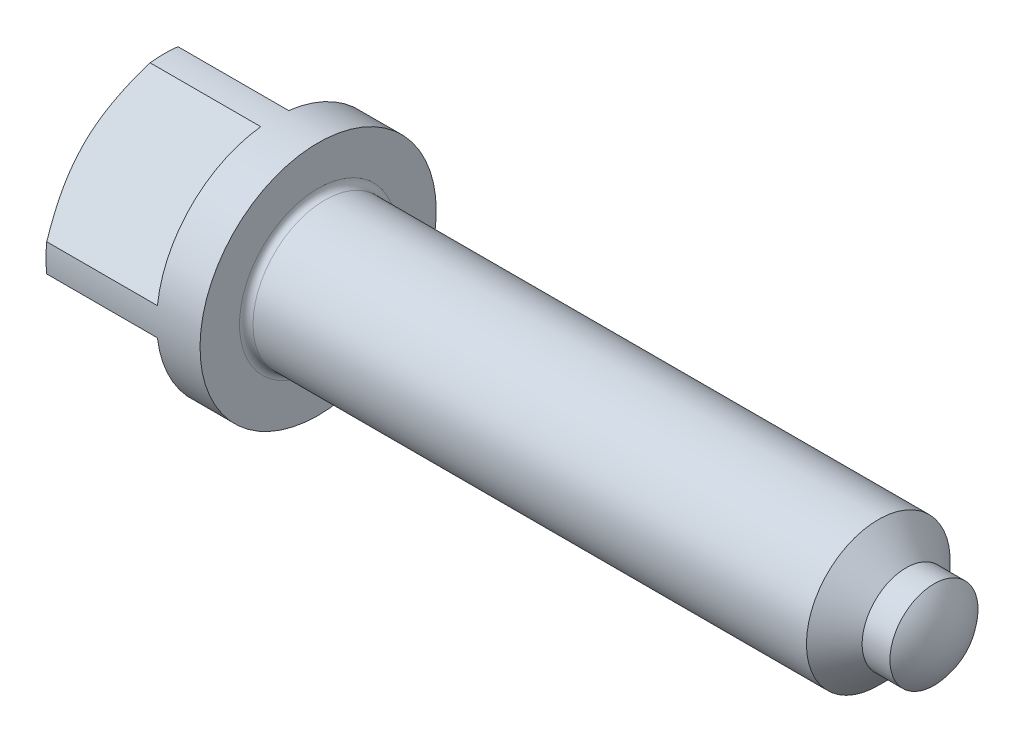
ISO-10303-21;
HEADER;
FILE_DESCRIPTION(('STEP AP214'),'2;1');
FILE_NAME('part.step','',(''),(''),'','','');
FILE_SCHEMA(('AUTOMOTIVE_DESIGN { 1 0 10303 214 1 1 1 1 }'));
ENDSEC;
DATA;
#1=APPLICATION_CONTEXT('core data for automotive mechanical design processes');
#2=APPLICATION_PROTOCOL_DEFINITION('international standard','automotive_design',2000,#1);
#3=PRODUCT_CONTEXT('',#1,'mechanical');
#4=PRODUCT('Part','Part','',(#3));
#5=PRODUCT_RELATED_PRODUCT_CATEGORY('part','',(#4));
#6=PRODUCT_DEFINITION_FORMATION('','',#4);
#7=PRODUCT_DEFINITION_CONTEXT('part definition',#1,'design');
#8=PRODUCT_DEFINITION('design','',#6,#7);
#9=PRODUCT_DEFINITION_SHAPE('','',#8);
#10=(LENGTH_UNIT() NAMED_UNIT(*) SI_UNIT(.MILLI.,.METRE.));
#11=(NAMED_UNIT(*) PLANE_ANGLE_UNIT() SI_UNIT($,.RADIAN.));
#12=(NAMED_UNIT(*) SI_UNIT($,.STERADIAN.) SOLID_ANGLE_UNIT());
#13=UNCERTAINTY_MEASURE_WITH_UNIT(LENGTH_MEASURE(1.E-05),#10,'distance_accuracy_value','');
#14=(GEOMETRIC_REPRESENTATION_CONTEXT(3) GLOBAL_UNCERTAINTY_ASSIGNED_CONTEXT((#13)) GLOBAL_UNIT_ASSIGNED_CONTEXT((#10,
#11,#12)) REPRESENTATION_CONTEXT('',''));
#15=CARTESIAN_POINT('',(0.,0.,0.));
#16=DIRECTION('',(0.,0.,1.));
#17=DIRECTION('',(1.,0.,0.));
#18=AXIS2_PLACEMENT_3D('',#15,#16,#17);
#19=CARTESIAN_POINT('',(20.,1.65445023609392,-13.90189895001));
#20=DIRECTION('',(0.,-0.707106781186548,0.707106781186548));
#21=DIRECTION('',(0.,-0.707106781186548,-0.707106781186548));
#22=AXIS2_PLACEMENT_3D('',#19,#20,#21);
#23=PLANE('',#22);
#24=DIRECTION('',(0.,0.707106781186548,0.707106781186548));
#25=VECTOR('',#24,1.);
#26=CARTESIAN_POINT('',(14.85,1.65445023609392,-13.90189895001));
#27=LINE('',#26,#25);
#28=CARTESIAN_POINT('',(14.85,1.65445023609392,-13.90189895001));
#29=VERTEX_POINT('',#28);
#30=CARTESIAN_POINT('',(14.85,13.90189895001,-1.65445023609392));
#31=VERTEX_POINT('',#30);
#32=EDGE_CURVE('E116',#29,#31,#27,.T.);
#33=ORIENTED_EDGE('',*,*,#32,.F.);
#34=DIRECTION('',(-1.,0.,0.));
#35=VECTOR('',#34,1.);
#36=CARTESIAN_POINT('',(20.,1.65445023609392,-13.90189895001));
#37=LINE('',#36,#35);
#38=CARTESIAN_POINT('',(1.73205080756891,1.65445023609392,-13.90189895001));
#39=VERTEX_POINT('',#38);
#40=EDGE_CURVE('E126',#29,#39,#37,.T.);
#41=ORIENTED_EDGE('',*,*,#40,.T.);
#42=CARTESIAN_POINT('',(1.73215182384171,13.90209895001,-1.65425023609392));
#43=CARTESIAN_POINT('',(1.66601831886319,13.7711586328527,-1.78519055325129));
#44=CARTESIAN_POINT('',(1.60104138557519,13.6399267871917,-1.91642239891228));
#45=CARTESIAN_POINT('',(1.47363094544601,13.3768397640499,-2.17950942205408));
#46=CARTESIAN_POINT('',(1.41119757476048,13.2449845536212,-2.31136463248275));
#47=CARTESIAN_POINT('',(1.22799989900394,12.8482955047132,-2.70805368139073));
#48=CARTESIAN_POINT('',(1.11141311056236,12.5824857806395,-2.9738634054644));
#49=CARTESIAN_POINT('',(0.890886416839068,12.0464411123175,-3.50990807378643));
#50=CARTESIAN_POINT('',(0.787029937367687,11.7761889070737,-3.78016027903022));
#51=CARTESIAN_POINT('',(0.595367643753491,11.2328750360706,-4.3234741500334));
#52=CARTESIAN_POINT('',(0.507559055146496,10.9598138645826,-4.59653532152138));
#53=CARTESIAN_POINT('',(0.353784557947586,10.4218744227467,-5.13447476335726));
#54=CARTESIAN_POINT('',(0.287090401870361,10.1571011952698,-5.39924799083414));
#55=CARTESIAN_POINT('',(0.173286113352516,9.62543079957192,-5.93091838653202));
#56=CARTESIAN_POINT('',(0.126176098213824,9.35853361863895,-6.19781556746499));
#57=CARTESIAN_POINT('',(0.0535591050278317,8.8240846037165,-6.73226458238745));
#58=CARTESIAN_POINT('',(0.0279860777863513,8.55653731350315,-6.9998118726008));
#59=CARTESIAN_POINT('',(-0.000656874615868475,8.02084215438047,-7.53550703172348));
#60=CARTESIAN_POINT('',(-0.00372786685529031,7.75269431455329,-7.80365487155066));
#61=CARTESIAN_POINT('',(0.0120411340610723,7.24025104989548,-8.31609813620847));
#62=CARTESIAN_POINT('',(0.0289841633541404,6.99592507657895,-8.56042410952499));
#63=CARTESIAN_POINT('',(0.081059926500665,6.50825268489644,-9.0480965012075));
#64=CARTESIAN_POINT('',(0.116192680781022,6.2649062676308,-9.29144291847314));
#65=CARTESIAN_POINT('',(0.203533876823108,5.77909949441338,-9.77724969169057));
#66=CARTESIAN_POINT('',(0.255788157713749,5.53664330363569,-10.0197058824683));
#67=CARTESIAN_POINT('',(0.375712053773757,5.05366332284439,-10.5026858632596));
#68=CARTESIAN_POINT('',(0.443381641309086,4.8131395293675,-10.7432096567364));
#69=CARTESIAN_POINT('',(0.595156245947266,4.32514748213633,-11.2312017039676));
#70=CARTESIAN_POINT('',(0.67978703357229,4.07776159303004,-11.4785875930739));
#71=CARTESIAN_POINT('',(0.861721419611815,3.5853161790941,-11.9710330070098));
#72=CARTESIAN_POINT('',(0.959026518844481,3.34025693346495,-12.216092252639));
#73=CARTESIAN_POINT('',(1.16386338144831,2.85377616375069,-12.7025730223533));
#74=CARTESIAN_POINT('',(1.27133564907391,2.61234201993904,-12.9440071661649));
#75=CARTESIAN_POINT('',(1.49533691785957,2.13169474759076,-13.4246544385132));
#76=CARTESIAN_POINT('',(1.6118619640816,1.89248069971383,-13.6638684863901));
#77=CARTESIAN_POINT('',(1.73215182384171,1.65425023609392,-13.90209895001));
#78=B_SPLINE_CURVE_WITH_KNOTS('',3,(#42,#43,#44,#45,#46,#47,#48,#49,#50,#51,#52,#53,#54,#55,#56,
#57,#58,#59,#60,#61,#62,#63,#64,#65,#66,#67,#68,#69,#70,#71,#72,#73,#74,#75,#76,#77),
.UNSPECIFIED.,.F.,.F.,(4,2,2,2,2,2,2,2,2,2,2,2,2,2,2,2,2,4),(0.,0.589890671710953,
1.17981287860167,2.36032226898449,3.54819549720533,4.73586316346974,5.87642136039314,
7.01698638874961,8.15404068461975,9.29104105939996,10.3283802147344,11.365720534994,
12.4058611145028,13.4459998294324,14.5255661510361,15.6052604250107,16.6789871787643,
17.7522474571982),.UNSPECIFIED.);
#79=CARTESIAN_POINT('',(0.,7.77817459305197,-7.77817459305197));
#80=VERTEX_POINT('',#79);
#81=EDGE_CURVE('E177',#80,#39,#78,.T.);
#82=ORIENTED_EDGE('',*,*,#81,.F.);
#83=CARTESIAN_POINT('',(1.73205080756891,13.90189895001,-1.65445023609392));
#84=VERTEX_POINT('',#83);
#85=EDGE_CURVE('E185',#84,#80,#78,.T.);
#86=ORIENTED_EDGE('',*,*,#85,.F.);
#87=DIRECTION('',(-1.,0.,0.));
#88=VECTOR('',#87,1.);
#89=CARTESIAN_POINT('',(20.,13.90189895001,-1.65445023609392));
#90=LINE('',#89,#88);
#91=EDGE_CURVE('E129',#31,#84,#90,.T.);
#92=ORIENTED_EDGE('',*,*,#91,.F.);
#93=EDGE_LOOP('',(#33,#41,#82,#86,#92));
#94=FACE_BOUND('',#93,.T.);
#95=ADVANCED_FACE('F34',(#94),#23,.F.);
#96=CARTESIAN_POINT('',(20.,13.90189895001,1.65445023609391));
#97=DIRECTION('',(0.,-0.707106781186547,-0.707106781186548));
#98=DIRECTION('',(0.,0.707106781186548,-0.707106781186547));
#99=AXIS2_PLACEMENT_3D('',#96,#97,#98);
#100=PLANE('',#99);
#101=DIRECTION('',(0.,-0.707106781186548,0.707106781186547));
#102=VECTOR('',#101,1.);
#103=CARTESIAN_POINT('',(14.85,13.90189895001,1.65445023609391));
#104=LINE('',#103,#102);
#105=CARTESIAN_POINT('',(14.85,13.90189895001,1.6544502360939));
#106=VERTEX_POINT('',#105);
#107=CARTESIAN_POINT('',(14.85,1.65445023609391,13.90189895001));
#108=VERTEX_POINT('',#107);
#109=EDGE_CURVE('E131',#106,#108,#104,.T.);
#110=ORIENTED_EDGE('',*,*,#109,.F.);
#111=DIRECTION('',(-1.,0.,0.));
#112=VECTOR('',#111,1.);
#113=CARTESIAN_POINT('',(20.,13.90189895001,1.65445023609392));
#114=LINE('',#113,#112);
#115=CARTESIAN_POINT('',(1.73205080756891,13.90189895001,1.65445023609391));
#116=VERTEX_POINT('',#115);
#117=EDGE_CURVE('E145',#106,#116,#114,.T.);
#118=ORIENTED_EDGE('',*,*,#117,.T.);
#119=CARTESIAN_POINT('',(1.7321518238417,1.65425023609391,13.90209895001));
#120=CARTESIAN_POINT('',(1.66601831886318,1.78519055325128,13.7711586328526));
#121=CARTESIAN_POINT('',(1.60104138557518,1.91642239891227,13.6399267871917));
#122=CARTESIAN_POINT('',(1.473630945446,2.17950942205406,13.3768397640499));
#123=CARTESIAN_POINT('',(1.41119757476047,2.31136463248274,13.2449845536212));
#124=CARTESIAN_POINT('',(1.22799989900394,2.70805368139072,12.8482955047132));
#125=CARTESIAN_POINT('',(1.11141311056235,2.97386340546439,12.5824857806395));
#126=CARTESIAN_POINT('',(0.890886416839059,3.50990807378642,12.0464411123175));
#127=CARTESIAN_POINT('',(0.787029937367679,3.78016027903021,11.7761889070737));
#128=CARTESIAN_POINT('',(0.595367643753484,4.32347415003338,11.2328750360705));
#129=CARTESIAN_POINT('',(0.507559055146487,4.59653532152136,10.9598138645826));
#130=CARTESIAN_POINT('',(0.353784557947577,5.13447476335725,10.4218744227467));
#131=CARTESIAN_POINT('',(0.287090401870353,5.39924799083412,10.1571011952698));
#132=CARTESIAN_POINT('',(0.173286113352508,5.93091838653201,9.62543079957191));
#133=CARTESIAN_POINT('',(0.126176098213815,6.19781556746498,9.35853361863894));
#134=CARTESIAN_POINT('',(0.0535591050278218,6.73226458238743,8.82408460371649));
#135=CARTESIAN_POINT('',(0.0279860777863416,6.99981187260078,8.55653731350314));
#136=CARTESIAN_POINT('',(-0.000656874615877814,7.53550703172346,8.02084215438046));
#137=CARTESIAN_POINT('',(-0.00372786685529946,7.80365487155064,7.75269431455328));
#138=CARTESIAN_POINT('',(0.0120411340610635,8.31609813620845,7.24025104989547));
#139=CARTESIAN_POINT('',(0.0289841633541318,8.56042410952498,6.99592507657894));
#140=CARTESIAN_POINT('',(0.0810599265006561,9.04809650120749,6.50825268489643));
#141=CARTESIAN_POINT('',(0.116192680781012,9.29144291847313,6.26490626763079));
#142=CARTESIAN_POINT('',(0.203533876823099,9.77724969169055,5.77909949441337));
#143=CARTESIAN_POINT('',(0.25578815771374,10.0197058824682,5.53664330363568));
#144=CARTESIAN_POINT('',(0.375712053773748,10.5026858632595,5.05366332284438));
#145=CARTESIAN_POINT('',(0.443381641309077,10.7432096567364,4.81313952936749));
#146=CARTESIAN_POINT('',(0.595156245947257,11.2312017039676,4.32514748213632));
#147=CARTESIAN_POINT('',(0.679787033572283,11.4785875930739,4.07776159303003));
#148=CARTESIAN_POINT('',(0.861721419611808,11.9710330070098,3.58531617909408));
#149=CARTESIAN_POINT('',(0.959026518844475,12.216092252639,3.34025693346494));
#150=CARTESIAN_POINT('',(1.16386338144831,12.7025730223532,2.85377616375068));
#151=CARTESIAN_POINT('',(1.2713356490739,12.9440071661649,2.61234201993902));
#152=CARTESIAN_POINT('',(1.49533691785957,13.4246544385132,2.13169474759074));
#153=CARTESIAN_POINT('',(1.6118619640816,13.6638684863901,1.89248069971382));
#154=CARTESIAN_POINT('',(1.73215182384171,13.90209895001,1.65425023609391));
#155=B_SPLINE_CURVE_WITH_KNOTS('',3,(#119,#120,#121,#122,#123,#124,#125,#126,#127,#128,#129,
#130,#131,#132,#133,#134,#135,#136,#137,#138,#139,#140,#141,#142,#143,#144,#145,#146,#147,#148,
#149,#150,#151,#152,#153,#154),.UNSPECIFIED.,.F.,.F.,(4,2,2,2,2,2,2,2,2,2,2,2,2,2,2,2,2,4),(0.,
0.589890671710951,1.17981287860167,2.36032226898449,3.54819549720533,4.73586316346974,
5.87642136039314,7.01698638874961,8.15404068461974,9.29104105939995,10.3283802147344,
11.365720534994,12.4058611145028,13.4459998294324,14.5255661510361,15.6052604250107,
16.6789871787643,17.7522474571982),.UNSPECIFIED.);
#156=CARTESIAN_POINT('',(0.,7.77817459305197,7.77817459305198));
#157=VERTEX_POINT('',#156);
#158=EDGE_CURVE('E281',#157,#116,#155,.T.);
#159=ORIENTED_EDGE('',*,*,#158,.F.);
#160=CARTESIAN_POINT('',(1.73205080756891,1.65445023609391,13.90189895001));
#161=VERTEX_POINT('',#160);
#162=EDGE_CURVE('E49',#161,#157,#155,.T.);
#163=ORIENTED_EDGE('',*,*,#162,.F.);
#164=DIRECTION('',(-1.,0.,0.));
#165=VECTOR('',#164,1.);
#166=CARTESIAN_POINT('',(20.,1.65445023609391,13.90189895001));
#167=LINE('',#166,#165);
#168=EDGE_CURVE('E276',#108,#161,#167,.T.);
#169=ORIENTED_EDGE('',*,*,#168,.F.);
#170=EDGE_LOOP('',(#110,#118,#159,#163,#169));
#171=FACE_BOUND('',#170,.T.);
#172=ADVANCED_FACE('F166',(#171),#100,.F.);
#173=CARTESIAN_POINT('',(20.,-13.90189895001,1.65445023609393));
#174=DIRECTION('',(0.,0.707106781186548,-0.707106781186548));
#175=DIRECTION('',(0.,0.707106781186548,0.707106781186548));
#176=AXIS2_PLACEMENT_3D('',#173,#174,#175);
#177=PLANE('',#176);
#178=DIRECTION('',(0.,-0.707106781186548,-0.707106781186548));
#179=VECTOR('',#178,1.);
#180=CARTESIAN_POINT('',(14.85,-13.90189895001,1.65445023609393));
#181=LINE('',#180,#179);
#182=CARTESIAN_POINT('',(14.85,-1.65445023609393,13.90189895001));
#183=VERTEX_POINT('',#182);
#184=CARTESIAN_POINT('',(14.85,-13.90189895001,1.65445023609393));
#185=VERTEX_POINT('',#184);
#186=EDGE_CURVE('E120',#183,#185,#181,.T.);
#187=ORIENTED_EDGE('',*,*,#186,.F.);
#188=DIRECTION('',(-1.,0.,0.));
#189=VECTOR('',#188,1.);
#190=CARTESIAN_POINT('',(20.,-1.65445023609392,13.90189895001));
#191=LINE('',#190,#189);
#192=CARTESIAN_POINT('',(1.73205080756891,-1.65445023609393,13.90189895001));
#193=VERTEX_POINT('',#192);
#194=EDGE_CURVE('E274',#183,#193,#191,.T.);
#195=ORIENTED_EDGE('',*,*,#194,.T.);
#196=CARTESIAN_POINT('',(1.73215182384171,-13.90209895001,1.65425023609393));
#197=CARTESIAN_POINT('',(1.66601831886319,-13.7711586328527,1.7851905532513));
#198=CARTESIAN_POINT('',(1.60104138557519,-13.6399267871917,1.91642239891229));
#199=CARTESIAN_POINT('',(1.47363094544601,-13.3768397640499,2.17950942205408));
#200=CARTESIAN_POINT('',(1.41119757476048,-13.2449845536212,2.31136463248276));
#201=CARTESIAN_POINT('',(1.22799989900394,-12.8482955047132,2.70805368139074));
#202=CARTESIAN_POINT('',(1.11141311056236,-12.5824857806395,2.9738634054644));
#203=CARTESIAN_POINT('',(0.890886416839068,-12.0464411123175,3.50990807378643));
#204=CARTESIAN_POINT('',(0.787029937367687,-11.7761889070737,3.78016027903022));
#205=CARTESIAN_POINT('',(0.595367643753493,-11.2328750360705,4.3234741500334));
#206=CARTESIAN_POINT('',(0.507559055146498,-10.9598138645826,4.59653532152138));
#207=CARTESIAN_POINT('',(0.353784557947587,-10.4218744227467,5.13447476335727));
#208=CARTESIAN_POINT('',(0.287090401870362,-10.1571011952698,5.39924799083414));
#209=CARTESIAN_POINT('',(0.173286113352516,-9.62543079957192,5.93091838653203));
#210=CARTESIAN_POINT('',(0.126176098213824,-9.35853361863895,6.197815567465));
#211=CARTESIAN_POINT('',(0.0535591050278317,-8.82408460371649,6.73226458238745));
#212=CARTESIAN_POINT('',(0.0279860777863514,-8.55653731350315,6.9998118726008));
#213=CARTESIAN_POINT('',(-0.000656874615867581,-8.02084215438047,7.53550703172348));
#214=CARTESIAN_POINT('',(-0.00372786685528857,-7.75269431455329,7.80365487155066));
#215=CARTESIAN_POINT('',(0.0120411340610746,-7.24025104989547,8.31609813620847));
#216=CARTESIAN_POINT('',(0.0289841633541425,-6.99592507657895,8.560424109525));
#217=CARTESIAN_POINT('',(0.0810599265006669,-6.50825268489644,9.04809650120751));
#218=CARTESIAN_POINT('',(0.116192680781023,-6.2649062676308,9.29144291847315));
#219=CARTESIAN_POINT('',(0.203533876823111,-5.77909949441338,9.77724969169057));
#220=CARTESIAN_POINT('',(0.255788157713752,-5.53664330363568,10.0197058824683));
#221=CARTESIAN_POINT('',(0.37571205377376,-5.05366332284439,10.5026858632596));
#222=CARTESIAN_POINT('',(0.443381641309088,-4.8131395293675,10.7432096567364));
#223=CARTESIAN_POINT('',(0.595156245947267,-4.32514748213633,11.2312017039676));
#224=CARTESIAN_POINT('',(0.679787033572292,-4.07776159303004,11.4785875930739));
#225=CARTESIAN_POINT('',(0.861721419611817,-3.58531617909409,11.9710330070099));
#226=CARTESIAN_POINT('',(0.959026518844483,-3.34025693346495,12.216092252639));
#227=CARTESIAN_POINT('',(1.16386338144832,-2.85377616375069,12.7025730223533));
#228=CARTESIAN_POINT('',(1.27133564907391,-2.61234201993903,12.9440071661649));
#229=CARTESIAN_POINT('',(1.49533691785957,-2.13169474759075,13.4246544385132));
#230=CARTESIAN_POINT('',(1.6118619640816,-1.89248069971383,13.6638684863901));
#231=CARTESIAN_POINT('',(1.73215182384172,-1.65425023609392,13.90209895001));
#232=B_SPLINE_CURVE_WITH_KNOTS('',3,(#196,#197,#198,#199,#200,#201,#202,#203,#204,#205,#206,
#207,#208,#209,#210,#211,#212,#213,#214,#215,#216,#217,#218,#219,#220,#221,#222,#223,#224,#225,
#226,#227,#228,#229,#230,#231),.UNSPECIFIED.,.F.,.F.,(4,2,2,2,2,2,2,2,2,2,2,2,2,2,2,2,2,4),(0.,
0.589890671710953,1.17981287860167,2.36032226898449,3.54819549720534,4.73586316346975,
5.87642136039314,7.01698638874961,8.15404068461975,9.29104105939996,10.3283802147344,
11.365720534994,12.4058611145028,13.4459998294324,14.5255661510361,15.6052604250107,
16.6789871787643,17.7522474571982),.UNSPECIFIED.);
#233=CARTESIAN_POINT('',(0.,-7.77817459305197,7.77817459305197));
#234=VERTEX_POINT('',#233);
#235=EDGE_CURVE('E223',#234,#193,#232,.T.);
#236=ORIENTED_EDGE('',*,*,#235,.F.);
#237=CARTESIAN_POINT('',(1.73205080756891,-13.90189895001,1.65445023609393));
#238=VERTEX_POINT('',#237);
#239=EDGE_CURVE('E57',#238,#234,#232,.T.);
#240=ORIENTED_EDGE('',*,*,#239,.F.);
#241=DIRECTION('',(-1.,0.,0.));
#242=VECTOR('',#241,1.);
#243=CARTESIAN_POINT('',(20.,-13.90189895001,1.65445023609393));
#244=LINE('',#243,#242);
#245=EDGE_CURVE('E272',#185,#238,#244,.T.);
#246=ORIENTED_EDGE('',*,*,#245,.F.);
#247=EDGE_LOOP('',(#187,#195,#236,#240,#246));
#248=FACE_BOUND('',#247,.T.);
#249=ADVANCED_FACE('F170',(#248),#177,.F.);
#250=CARTESIAN_POINT('',(20.,-1.65445023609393,-13.90189895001));
#251=DIRECTION('',(0.,0.707106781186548,0.707106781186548));
#252=DIRECTION('',(0.,-0.707106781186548,0.707106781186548));
#253=AXIS2_PLACEMENT_3D('',#250,#251,#252);
#254=PLANE('',#253);
#255=DIRECTION('',(0.,0.707106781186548,-0.707106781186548));
#256=VECTOR('',#255,1.);
#257=CARTESIAN_POINT('',(14.85,-1.65445023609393,-13.90189895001));
#258=LINE('',#257,#256);
#259=CARTESIAN_POINT('',(14.85,-13.90189895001,-1.65445023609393));
#260=VERTEX_POINT('',#259);
#261=CARTESIAN_POINT('',(14.85,-1.65445023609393,-13.90189895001));
#262=VERTEX_POINT('',#261);
#263=EDGE_CURVE('E149',#260,#262,#258,.T.);
#264=ORIENTED_EDGE('',*,*,#263,.F.);
#265=DIRECTION('',(-1.,0.,0.));
#266=VECTOR('',#265,1.);
#267=CARTESIAN_POINT('',(20.,-13.90189895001,-1.65445023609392));
#268=LINE('',#267,#266);
#269=CARTESIAN_POINT('',(1.73205080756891,-13.90189895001,-1.65445023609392));
#270=VERTEX_POINT('',#269);
#271=EDGE_CURVE('E270',#260,#270,#268,.T.);
#272=ORIENTED_EDGE('',*,*,#271,.T.);
#273=CARTESIAN_POINT('',(1.73215182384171,-1.65425023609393,-13.90209895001));
#274=CARTESIAN_POINT('',(1.66601831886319,-1.7851905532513,-13.7711586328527));
#275=CARTESIAN_POINT('',(1.60104138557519,-1.91642239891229,-13.6399267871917));
#276=CARTESIAN_POINT('',(1.47363094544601,-2.17950942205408,-13.3768397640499));
#277=CARTESIAN_POINT('',(1.41119757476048,-2.31136463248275,-13.2449845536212));
#278=CARTESIAN_POINT('',(1.22799989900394,-2.70805368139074,-12.8482955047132));
#279=CARTESIAN_POINT('',(1.11141311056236,-2.9738634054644,-12.5824857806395));
#280=CARTESIAN_POINT('',(0.890886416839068,-3.50990807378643,-12.0464411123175));
#281=CARTESIAN_POINT('',(0.787029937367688,-3.78016027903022,-11.7761889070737));
#282=CARTESIAN_POINT('',(0.595367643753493,-4.3234741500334,-11.2328750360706));
#283=CARTESIAN_POINT('',(0.507559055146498,-4.59653532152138,-10.9598138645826));
#284=CARTESIAN_POINT('',(0.353784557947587,-5.13447476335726,-10.4218744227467));
#285=CARTESIAN_POINT('',(0.287090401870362,-5.39924799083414,-10.1571011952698));
#286=CARTESIAN_POINT('',(0.173286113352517,-5.93091838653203,-9.62543079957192));
#287=CARTESIAN_POINT('',(0.126176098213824,-6.197815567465,-9.35853361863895));
#288=CARTESIAN_POINT('',(0.0535591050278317,-6.73226458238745,-8.8240846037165));
#289=CARTESIAN_POINT('',(0.0279860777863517,-6.9998118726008,-8.55653731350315));
#290=CARTESIAN_POINT('',(-0.000656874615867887,-7.53550703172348,-8.02084215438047));
#291=CARTESIAN_POINT('',(-0.00372786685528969,-7.80365487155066,-7.75269431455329));
#292=CARTESIAN_POINT('',(0.0120411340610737,-8.31609813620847,-7.24025104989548));
#293=CARTESIAN_POINT('',(0.0289841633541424,-8.56042410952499,-6.99592507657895));
#294=CARTESIAN_POINT('',(0.081059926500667,-9.0480965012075,-6.50825268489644));
#295=CARTESIAN_POINT('',(0.116192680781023,-9.29144291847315,-6.2649062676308));
#296=CARTESIAN_POINT('',(0.203533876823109,-9.77724969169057,-5.77909949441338));
#297=CARTESIAN_POINT('',(0.25578815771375,-10.0197058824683,-5.53664330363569));
#298=CARTESIAN_POINT('',(0.375712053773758,-10.5026858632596,-5.05366332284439));
#299=CARTESIAN_POINT('',(0.443381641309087,-10.7432096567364,-4.8131395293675));
#300=CARTESIAN_POINT('',(0.595156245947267,-11.2312017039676,-4.32514748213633));
#301=CARTESIAN_POINT('',(0.679787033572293,-11.4785875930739,-4.07776159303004));
#302=CARTESIAN_POINT('',(0.861721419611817,-11.9710330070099,-3.5853161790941));
#303=CARTESIAN_POINT('',(0.959026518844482,-12.216092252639,-3.34025693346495));
#304=CARTESIAN_POINT('',(1.16386338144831,-12.7025730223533,-2.85377616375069));
#305=CARTESIAN_POINT('',(1.27133564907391,-12.9440071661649,-2.61234201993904));
#306=CARTESIAN_POINT('',(1.49533691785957,-13.4246544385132,-2.13169474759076));
#307=CARTESIAN_POINT('',(1.6118619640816,-13.6638684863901,-1.89248069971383));
#308=CARTESIAN_POINT('',(1.73215182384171,-13.90209895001,-1.65425023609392));
#309=B_SPLINE_CURVE_WITH_KNOTS('',3,(#273,#274,#275,#276,#277,#278,#279,#280,#281,#282,#283,
#284,#285,#286,#287,#288,#289,#290,#291,#292,#293,#294,#295,#296,#297,#298,#299,#300,#301,#302,
#303,#304,#305,#306,#307,#308),.UNSPECIFIED.,.F.,.F.,(4,2,2,2,2,2,2,2,2,2,2,2,2,2,2,2,2,4),(0.,
0.589890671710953,1.17981287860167,2.36032226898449,3.54819549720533,4.73586316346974,
5.87642136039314,7.01698638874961,8.15404068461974,9.29104105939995,10.3283802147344,
11.365720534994,12.4058611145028,13.4459998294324,14.5255661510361,15.6052604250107,
16.6789871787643,17.7522474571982),.UNSPECIFIED.);
#310=CARTESIAN_POINT('',(0.,-7.77817459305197,-7.77817459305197));
#311=VERTEX_POINT('',#310);
#312=EDGE_CURVE('E207',#311,#270,#309,.T.);
#313=ORIENTED_EDGE('',*,*,#312,.F.);
#314=CARTESIAN_POINT('',(1.73205080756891,-1.65445023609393,-13.90189895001));
#315=VERTEX_POINT('',#314);
#316=EDGE_CURVE('E295',#315,#311,#309,.T.);
#317=ORIENTED_EDGE('',*,*,#316,.F.);
#318=DIRECTION('',(-1.,0.,0.));
#319=VECTOR('',#318,1.);
#320=CARTESIAN_POINT('',(20.,-1.65445023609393,-13.90189895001));
#321=LINE('',#320,#319);
#322=EDGE_CURVE('E268',#262,#315,#321,.T.);
#323=ORIENTED_EDGE('',*,*,#322,.F.);
#324=EDGE_LOOP('',(#264,#272,#313,#317,#323));
#325=FACE_BOUND('',#324,.T.);
#326=ADVANCED_FACE('F227',(#325),#254,.F.);
#327=CARTESIAN_POINT('',(20.,0.,0.));
#328=DIRECTION('',(-1.,0.,0.));
#329=DIRECTION('',(0.,0.,1.));
#330=AXIS2_PLACEMENT_3D('',#327,#328,#329);
#331=CYLINDRICAL_SURFACE('',#330,14.);
#332=CARTESIAN_POINT('',(14.85,0.,0.));
#333=DIRECTION('',(1.,0.,0.));
#334=DIRECTION('',(0.,0.,-1.));
#335=AXIS2_PLACEMENT_3D('',#332,#333,#334);
#336=CIRCLE('',#335,14.);
#337=EDGE_CURVE('E123',#260,#262,#336,.T.);
#338=ORIENTED_EDGE('',*,*,#337,.T.);
#339=ORIENTED_EDGE('',*,*,#322,.T.);
#340=CARTESIAN_POINT('',(1.73205080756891,0.,0.));
#341=DIRECTION('',(1.,0.,0.));
#342=DIRECTION('',(0.,0.,-1.));
#343=AXIS2_PLACEMENT_3D('',#340,#341,#342);
#344=CIRCLE('',#343,14.);
#345=EDGE_CURVE('E138',#39,#315,#344,.F.);
#346=ORIENTED_EDGE('',*,*,#345,.F.);
#347=ORIENTED_EDGE('',*,*,#40,.F.);
#348=EDGE_CURVE('E113',#29,#31,#336,.T.);
#349=ORIENTED_EDGE('',*,*,#348,.T.);
#350=ORIENTED_EDGE('',*,*,#91,.T.);
#351=CARTESIAN_POINT('',(1.73205080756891,0.,0.));
#352=DIRECTION('',(1.,0.,0.));
#353=DIRECTION('',(0.,0.,-1.));
#354=AXIS2_PLACEMENT_3D('',#351,#352,#353);
#355=CIRCLE('',#354,14.);
#356=EDGE_CURVE('E191',#116,#84,#355,.F.);
#357=ORIENTED_EDGE('',*,*,#356,.F.);
#358=ORIENTED_EDGE('',*,*,#117,.F.);
#359=EDGE_CURVE('E121',#106,#108,#336,.T.);
#360=ORIENTED_EDGE('',*,*,#359,.T.);
#361=ORIENTED_EDGE('',*,*,#168,.T.);
#362=CARTESIAN_POINT('',(1.73205080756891,0.,0.));
#363=DIRECTION('',(1.,0.,0.));
#364=DIRECTION('',(0.,0.,-1.));
#365=AXIS2_PLACEMENT_3D('',#362,#363,#364);
#366=CIRCLE('',#365,14.);
#367=EDGE_CURVE('E288',#193,#161,#366,.F.);
#368=ORIENTED_EDGE('',*,*,#367,.F.);
#369=ORIENTED_EDGE('',*,*,#194,.F.);
#370=EDGE_CURVE('E307',#183,#185,#336,.T.);
#371=ORIENTED_EDGE('',*,*,#370,.T.);
#372=ORIENTED_EDGE('',*,*,#245,.T.);
#373=CARTESIAN_POINT('',(1.73205080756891,0.,0.));
#374=DIRECTION('',(1.,0.,0.));
#375=DIRECTION('',(0.,0.,-1.));
#376=AXIS2_PLACEMENT_3D('',#373,#374,#375);
#377=CIRCLE('',#376,14.);
#378=EDGE_CURVE('E222',#270,#238,#377,.F.);
#379=ORIENTED_EDGE('',*,*,#378,.F.);
#380=ORIENTED_EDGE('',*,*,#271,.F.);
#381=EDGE_LOOP('',(#338,#339,#346,#347,#349,#350,#357,#358,#360,#361,#368,#369,#371,#372,#379,#380));
#382=FACE_BOUND('',#381,.T.);
#383=CARTESIAN_POINT('',(20.,0.,0.));
#384=DIRECTION('',(1.,0.,0.));
#385=DIRECTION('',(0.,0.,-1.));
#386=AXIS2_PLACEMENT_3D('',#383,#384,#385);
#387=CIRCLE('',#386,14.);
#388=CARTESIAN_POINT('',(20.,0.,-14.));
#389=VERTEX_POINT('',#388);
#390=EDGE_CURVE('E263',#389,#389,#387,.T.);
#391=ORIENTED_EDGE('',*,*,#390,.F.);
#392=EDGE_LOOP('',(#391));
#393=FACE_BOUND('',#392,.T.);
#394=ADVANCED_FACE('F135',(#382,#393),#331,.T.);
#395=CARTESIAN_POINT('',(20.,0.,0.));
#396=DIRECTION('',(1.,0.,0.));
#397=DIRECTION('',(0.,0.,-1.));
#398=AXIS2_PLACEMENT_3D('',#395,#396,#397);
#399=PLANE('',#398);
#400=CARTESIAN_POINT('',(20.,0.,0.));
#401=DIRECTION('',(1.,0.,0.));
#402=DIRECTION('',(0.,0.,-1.));
#403=AXIS2_PLACEMENT_3D('',#400,#401,#402);
#404=CIRCLE('',#403,9.32079728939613);
#405=CARTESIAN_POINT('',(20.,0.,-9.32079728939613));
#406=VERTEX_POINT('',#405);
#407=EDGE_CURVE('E42',#406,#406,#404,.F.);
#408=ORIENTED_EDGE('',*,*,#407,.T.);
#409=EDGE_LOOP('',(#408));
#410=FACE_BOUND('',#409,.T.);
#411=ORIENTED_EDGE('',*,*,#390,.T.);
#412=EDGE_LOOP('',(#411));
#413=FACE_BOUND('',#412,.T.);
#414=ADVANCED_FACE('F153',(#410,#413),#399,.T.);
#415=CARTESIAN_POINT('',(87.1841145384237,0.,0.));
#416=DIRECTION('',(-1.,0.,0.));
#417=DIRECTION('',(0.,1.,0.));
#418=AXIS2_PLACEMENT_3D('',#415,#416,#417);
#419=SPHERICAL_SURFACE('',#418,7.81588546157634);
#420=CARTESIAN_POINT('',(93.,0.,0.));
#421=DIRECTION('',(-1.,0.,0.));
#422=DIRECTION('',(0.,0.,1.));
#423=AXIS2_PLACEMENT_3D('',#420,#421,#422);
#424=CIRCLE('',#423,5.22145016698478);
#425=CARTESIAN_POINT('',(93.,0.,5.22145016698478));
#426=VERTEX_POINT('',#425);
#427=EDGE_CURVE('E260',#426,#426,#424,.T.);
#428=ORIENTED_EDGE('',*,*,#427,.F.);
#429=EDGE_LOOP('',(#428));
#430=FACE_BOUND('',#429,.T.);
#431=ADVANCED_FACE('F239',(#430),#419,.T.);
#432=CARTESIAN_POINT('',(0.,0.,0.));
#433=DIRECTION('',(-1.,0.,0.));
#434=DIRECTION('',(0.,0.,1.));
#435=AXIS2_PLACEMENT_3D('',#432,#433,#434);
#436=CYLINDRICAL_SURFACE('',#435,5.22145016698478);
#437=CARTESIAN_POINT('',(89.7,0.,0.));
#438=DIRECTION('',(-1.,0.,0.));
#439=DIRECTION('',(0.,0.,1.));
#440=AXIS2_PLACEMENT_3D('',#437,#438,#439);
#441=CIRCLE('',#440,5.22145016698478);
#442=CARTESIAN_POINT('',(89.7,0.,5.22145016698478));
#443=VERTEX_POINT('',#442);
#444=EDGE_CURVE('E259',#443,#443,#441,.T.);
#445=ORIENTED_EDGE('',*,*,#444,.F.);
#446=EDGE_LOOP('',(#445));
#447=FACE_BOUND('',#446,.T.);
#448=ORIENTED_EDGE('',*,*,#427,.T.);
#449=EDGE_LOOP('',(#448));
#450=FACE_BOUND('',#449,.T.);
#451=ADVANCED_FACE('F242',(#447,#450),#436,.T.);
#452=CARTESIAN_POINT('',(89.7,0.,0.));
#453=DIRECTION('',(-1.,0.,0.));
#454=DIRECTION('',(0.,0.,1.));
#455=AXIS2_PLACEMENT_3D('',#452,#453,#454);
#456=CONICAL_SURFACE('',#455,5.22145016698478,0.78539816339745);
#457=CARTESIAN_POINT('',(86.4006528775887,0.,0.));
#458=DIRECTION('',(-1.,0.,0.));
#459=DIRECTION('',(0.,0.,1.));
#460=AXIS2_PLACEMENT_3D('',#457,#458,#459);
#461=CIRCLE('',#460,8.52079728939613);
#462=CARTESIAN_POINT('',(86.4006528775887,0.,8.52079728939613));
#463=VERTEX_POINT('',#462);
#464=EDGE_CURVE('E256',#463,#463,#461,.T.);
#465=ORIENTED_EDGE('',*,*,#464,.F.);
#466=EDGE_LOOP('',(#465));
#467=FACE_BOUND('',#466,.T.);
#468=ORIENTED_EDGE('',*,*,#444,.T.);
#469=EDGE_LOOP('',(#468));
#470=FACE_BOUND('',#469,.T.);
#471=ADVANCED_FACE('F245',(#467,#470),#456,.T.);
#472=CARTESIAN_POINT('',(0.,0.,0.));
#473=DIRECTION('',(-1.,0.,0.));
#474=DIRECTION('',(0.,0.,1.));
#475=AXIS2_PLACEMENT_3D('',#472,#473,#474);
#476=CYLINDRICAL_SURFACE('',#475,8.52079728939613);
#477=CARTESIAN_POINT('',(20.8,0.,0.));
#478=DIRECTION('',(1.,0.,0.));
#479=DIRECTION('',(0.,0.,-1.));
#480=AXIS2_PLACEMENT_3D('',#477,#478,#479);
#481=CIRCLE('',#480,8.52079728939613);
#482=CARTESIAN_POINT('',(20.8,0.,-8.52079728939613));
#483=VERTEX_POINT('',#482);
#484=EDGE_CURVE('E12',#483,#483,#481,.T.);
#485=ORIENTED_EDGE('',*,*,#484,.T.);
#486=EDGE_LOOP('',(#485));
#487=FACE_BOUND('',#486,.T.);
#488=ORIENTED_EDGE('',*,*,#464,.T.);
#489=EDGE_LOOP('',(#488));
#490=FACE_BOUND('',#489,.T.);
#491=ADVANCED_FACE('F202',(#487,#490),#476,.T.);
#492=CARTESIAN_POINT('',(0.,0.,0.));
#493=DIRECTION('',(1.,0.,0.));
#494=DIRECTION('',(0.,0.,-1.));
#495=AXIS2_PLACEMENT_3D('',#492,#493,#494);
#496=CONICAL_SURFACE('',#495,10.9999999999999,1.0471975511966);
#497=ORIENTED_EDGE('',*,*,#81,.T.);
#498=ORIENTED_EDGE('',*,*,#345,.T.);
#499=ORIENTED_EDGE('',*,*,#316,.T.);
#500=CARTESIAN_POINT('',(0.,0.,0.));
#501=DIRECTION('',(1.,0.,0.));
#502=DIRECTION('',(0.,0.,-1.));
#503=AXIS2_PLACEMENT_3D('',#500,#501,#502);
#504=CIRCLE('',#503,10.9999999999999);
#505=EDGE_CURVE('E139',#311,#80,#504,.T.);
#506=ORIENTED_EDGE('',*,*,#505,.T.);
#507=EDGE_LOOP('',(#497,#498,#499,#506));
#508=FACE_BOUND('',#507,.T.);
#509=ADVANCED_FACE('F200',(#508),#496,.T.);
#510=ORIENTED_EDGE('',*,*,#239,.T.);
#511=EDGE_CURVE('E142',#234,#311,#504,.T.);
#512=ORIENTED_EDGE('',*,*,#511,.T.);
#513=ORIENTED_EDGE('',*,*,#312,.T.);
#514=ORIENTED_EDGE('',*,*,#378,.T.);
#515=EDGE_LOOP('',(#510,#512,#513,#514));
#516=FACE_BOUND('',#515,.T.);
#517=ADVANCED_FACE('F201',(#516),#496,.T.);
#518=ORIENTED_EDGE('',*,*,#162,.T.);
#519=EDGE_CURVE('E144',#157,#234,#504,.T.);
#520=ORIENTED_EDGE('',*,*,#519,.T.);
#521=ORIENTED_EDGE('',*,*,#235,.T.);
#522=ORIENTED_EDGE('',*,*,#367,.T.);
#523=EDGE_LOOP('',(#518,#520,#521,#522));
#524=FACE_BOUND('',#523,.T.);
#525=ADVANCED_FACE('F198',(#524),#496,.T.);
#526=ORIENTED_EDGE('',*,*,#356,.T.);
#527=ORIENTED_EDGE('',*,*,#85,.T.);
#528=CARTESIAN_POINT('',(0.,0.,0.));
#529=DIRECTION('',(-1.,0.,0.));
#530=DIRECTION('',(0.,0.,1.));
#531=AXIS2_PLACEMENT_3D('',#528,#529,#530);
#532=CIRCLE('',#531,10.9999999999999);
#533=EDGE_CURVE('E130',#157,#80,#532,.T.);
#534=ORIENTED_EDGE('',*,*,#533,.F.);
#535=ORIENTED_EDGE('',*,*,#158,.T.);
#536=EDGE_LOOP('',(#526,#527,#534,#535));
#537=FACE_BOUND('',#536,.T.);
#538=ADVANCED_FACE('F193',(#537),#496,.T.);
#539=CARTESIAN_POINT('',(0.,0.,0.));
#540=DIRECTION('',(1.,0.,0.));
#541=DIRECTION('',(0.,0.,-1.));
#542=AXIS2_PLACEMENT_3D('',#539,#540,#541);
#543=PLANE('',#542);
#544=ORIENTED_EDGE('',*,*,#533,.T.);
#545=ORIENTED_EDGE('',*,*,#505,.F.);
#546=ORIENTED_EDGE('',*,*,#511,.F.);
#547=ORIENTED_EDGE('',*,*,#519,.F.);
#548=EDGE_LOOP('',(#544,#545,#546,#547));
#549=FACE_BOUND('',#548,.T.);
#550=ADVANCED_FACE('F197',(#549),#543,.F.);
#551=CARTESIAN_POINT('',(14.85,0.,0.));
#552=DIRECTION('',(1.,0.,0.));
#553=DIRECTION('',(0.,0.,-1.));
#554=AXIS2_PLACEMENT_3D('',#551,#552,#553);
#555=PLANE('',#554);
#556=ORIENTED_EDGE('',*,*,#337,.F.);
#557=ORIENTED_EDGE('',*,*,#263,.T.);
#558=EDGE_LOOP('',(#556,#557));
#559=FACE_BOUND('',#558,.T.);
#560=ADVANCED_FACE('F163',(#559),#555,.F.);
#561=ORIENTED_EDGE('',*,*,#370,.F.);
#562=ORIENTED_EDGE('',*,*,#186,.T.);
#563=EDGE_LOOP('',(#561,#562));
#564=FACE_BOUND('',#563,.T.);
#565=ADVANCED_FACE('F306',(#564),#555,.F.);
#566=ORIENTED_EDGE('',*,*,#359,.F.);
#567=ORIENTED_EDGE('',*,*,#109,.T.);
#568=EDGE_LOOP('',(#566,#567));
#569=FACE_BOUND('',#568,.T.);
#570=ADVANCED_FACE('F161',(#569),#555,.F.);
#571=ORIENTED_EDGE('',*,*,#348,.F.);
#572=ORIENTED_EDGE('',*,*,#32,.T.);
#573=EDGE_LOOP('',(#571,#572));
#574=FACE_BOUND('',#573,.T.);
#575=ADVANCED_FACE('F115',(#574),#555,.F.);
#576=CARTESIAN_POINT('',(20.8,0.,0.));
#577=DIRECTION('',(1.,0.,0.));
#578=DIRECTION('',(0.,0.,-1.));
#579=AXIS2_PLACEMENT_3D('',#576,#577,#578);
#580=TOROIDAL_SURFACE('',#579,9.32079728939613,0.8);
#581=ORIENTED_EDGE('',*,*,#484,.F.);
#582=EDGE_LOOP('',(#581));
#583=FACE_BOUND('',#582,.T.);
#584=ORIENTED_EDGE('',*,*,#407,.F.);
#585=EDGE_LOOP('',(#584));
#586=FACE_BOUND('',#585,.T.);
#587=ADVANCED_FACE('F36',(#583,#586),#580,.F.);
#588=CLOSED_SHELL('',(#95,#172,#249,#326,#394,#414,#431,#451,#471,#491,#509,#517,#525,#538,#550,
#560,#565,#570,#575,#587));
#589=MANIFOLD_SOLID_BREP('B2',#588);
#590=ADVANCED_BREP_SHAPE_REPRESENTATION('',(#18,#589),#14);
#591=SHAPE_DEFINITION_REPRESENTATION(#9,#590);
ENDSEC;
END-ISO-10303-21;
